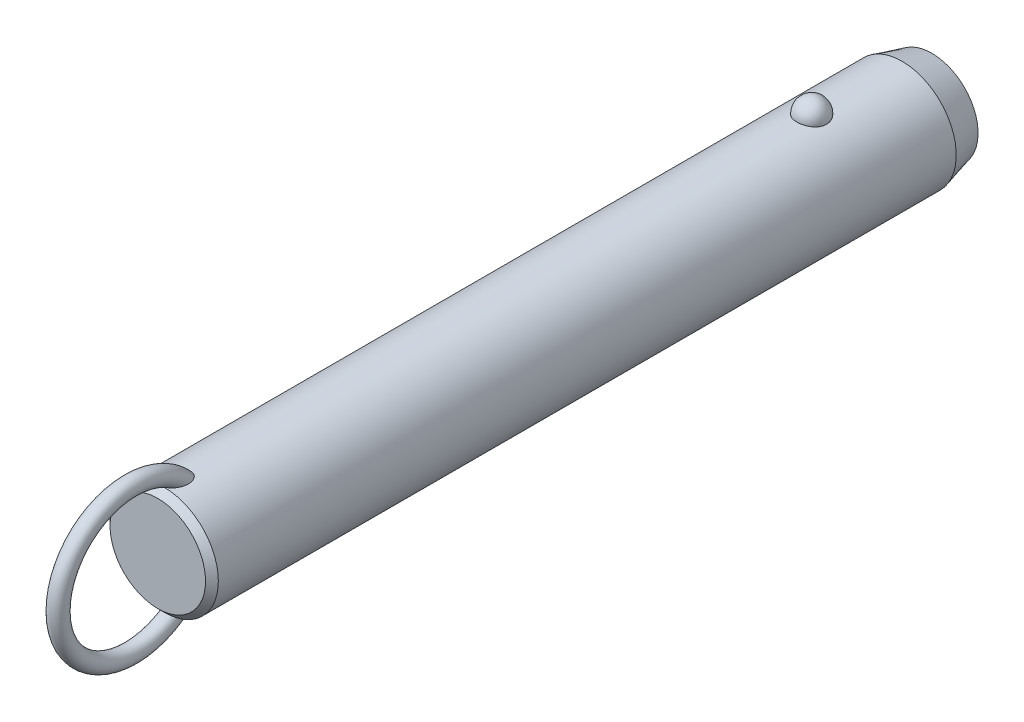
ISO-10303-21;
HEADER;
FILE_DESCRIPTION(('STEP AP214'),'2;1');
FILE_NAME('part.step','',(''),(''),'','','');
FILE_SCHEMA(('AUTOMOTIVE_DESIGN { 1 0 10303 214 1 1 1 1 }'));
ENDSEC;
DATA;
#1=APPLICATION_CONTEXT('core data for automotive mechanical design processes');
#2=APPLICATION_PROTOCOL_DEFINITION('international standard','automotive_design',2000,#1);
#3=PRODUCT_CONTEXT('',#1,'mechanical');
#4=PRODUCT('Part','Part','',(#3));
#5=PRODUCT_RELATED_PRODUCT_CATEGORY('part','',(#4));
#6=PRODUCT_DEFINITION_FORMATION('','',#4);
#7=PRODUCT_DEFINITION_CONTEXT('part definition',#1,'design');
#8=PRODUCT_DEFINITION('design','',#6,#7);
#9=PRODUCT_DEFINITION_SHAPE('','',#8);
#10=(LENGTH_UNIT() NAMED_UNIT(*) SI_UNIT(.MILLI.,.METRE.));
#11=(NAMED_UNIT(*) PLANE_ANGLE_UNIT() SI_UNIT($,.RADIAN.));
#12=(NAMED_UNIT(*) SI_UNIT($,.STERADIAN.) SOLID_ANGLE_UNIT());
#13=UNCERTAINTY_MEASURE_WITH_UNIT(LENGTH_MEASURE(1.E-05),#10,'distance_accuracy_value','');
#14=(GEOMETRIC_REPRESENTATION_CONTEXT(3) GLOBAL_UNCERTAINTY_ASSIGNED_CONTEXT((#13)) GLOBAL_UNIT_ASSIGNED_CONTEXT((#10,
#11,#12)) REPRESENTATION_CONTEXT('',''));
#15=CARTESIAN_POINT('',(0.,0.,0.));
#16=DIRECTION('',(0.,0.,1.));
#17=DIRECTION('',(1.,0.,0.));
#18=AXIS2_PLACEMENT_3D('',#15,#16,#17);
#19=CARTESIAN_POINT('',(0.,0.,137.2));
#20=DIRECTION('',(0.,0.,-1.));
#21=DIRECTION('',(-1.,0.,0.));
#22=AXIS2_PLACEMENT_3D('',#19,#20,#21);
#23=CYLINDRICAL_SURFACE('',#22,12.7);
#24=CARTESIAN_POINT('',(3.46661256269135,12.2177165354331,-3.5));
#25=CARTESIAN_POINT('',(3.4666090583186,12.2177194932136,-3.30432790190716));
#26=CARTESIAN_POINT('',(3.45063567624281,12.2222841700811,-3.10861112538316));
#27=CARTESIAN_POINT('',(3.38712451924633,12.2400345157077,-2.72271899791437));
#28=CARTESIAN_POINT('',(3.33957415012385,12.2532236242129,-2.53254588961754));
#29=CARTESIAN_POINT('',(3.2141234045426,12.286724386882,-2.16324948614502));
#30=CARTESIAN_POINT('',(3.13623639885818,12.3070329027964,-1.98412136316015));
#31=CARTESIAN_POINT('',(2.95205930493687,12.3525018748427,-1.64180592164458));
#32=CARTESIAN_POINT('',(2.84577003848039,12.3776621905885,-1.47861814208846));
#33=CARTESIAN_POINT('',(2.60688050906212,12.4301712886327,-1.17190583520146));
#34=CARTESIAN_POINT('',(2.47415697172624,12.4575299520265,-1.02847897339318));
#35=CARTESIAN_POINT('',(2.18615174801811,12.5112810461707,-0.766177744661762));
#36=CARTESIAN_POINT('',(2.03087002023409,12.5376734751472,-0.64730342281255));
#37=CARTESIAN_POINT('',(1.70237334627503,12.5864761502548,-0.437732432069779));
#38=CARTESIAN_POINT('',(1.52920948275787,12.6088972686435,-0.346958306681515));
#39=CARTESIAN_POINT('',(1.16944170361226,12.6473352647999,-0.195750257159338));
#40=CARTESIAN_POINT('',(0.982839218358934,12.663352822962,-0.135313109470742));
#41=CARTESIAN_POINT('',(0.604961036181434,12.6869706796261,-0.0473241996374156));
#42=CARTESIAN_POINT('',(0.41382314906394,12.6947125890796,-0.0192185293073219));
#43=CARTESIAN_POINT('',(0.0293827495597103,12.7014203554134,0.0051725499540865));
#44=CARTESIAN_POINT('',(-0.163919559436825,12.7003870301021,0.00146092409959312));
#45=CARTESIAN_POINT('',(-0.544374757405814,12.689735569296,-0.0373939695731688));
#46=CARTESIAN_POINT('',(-0.731575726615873,12.6802364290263,-0.0721015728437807));
#47=CARTESIAN_POINT('',(-1.09733277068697,12.6538333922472,-0.171364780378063));
#48=CARTESIAN_POINT('',(-1.27588869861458,12.6369293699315,-0.235920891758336));
#49=CARTESIAN_POINT('',(-1.6204698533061,12.5973946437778,-0.393548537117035));
#50=CARTESIAN_POINT('',(-1.78641865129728,12.5747321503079,-0.486778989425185));
#51=CARTESIAN_POINT('',(-2.10030671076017,12.5261316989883,-0.699110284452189));
#52=CARTESIAN_POINT('',(-2.24824419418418,12.5001934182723,-0.818213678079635));
#53=CARTESIAN_POINT('',(-2.52491489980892,12.4472906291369,-1.08157124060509));
#54=CARTESIAN_POINT('',(-2.65324222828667,12.4203160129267,-1.22624992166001));
#55=CARTESIAN_POINT('',(-2.88410007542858,12.3687509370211,-1.53528325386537));
#56=CARTESIAN_POINT('',(-2.98662883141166,12.3441606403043,-1.69963924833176));
#57=CARTESIAN_POINT('',(-3.16432417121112,12.2998199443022,-2.04548497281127));
#58=CARTESIAN_POINT('',(-3.23917525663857,12.2801261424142,-2.22714424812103));
#59=CARTESIAN_POINT('',(-3.35800573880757,12.248167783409,-2.6009138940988));
#60=CARTESIAN_POINT('',(-3.4019860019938,12.2359030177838,-2.79302397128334));
#61=CARTESIAN_POINT('',(-3.45784812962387,12.2202347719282,-3.18140279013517));
#62=CARTESIAN_POINT('',(-3.46986123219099,12.2167950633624,-3.37765118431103));
#63=CARTESIAN_POINT('',(-3.46186273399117,12.2190638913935,-3.76943689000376));
#64=CARTESIAN_POINT('',(-3.44185196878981,12.2247721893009,-3.96497421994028));
#65=CARTESIAN_POINT('',(-3.37048652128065,12.2446381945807,-4.34881728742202));
#66=CARTESIAN_POINT('',(-3.31928253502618,12.2587552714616,-4.53715319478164));
#67=CARTESIAN_POINT('',(-3.18693461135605,12.2938237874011,-4.90231727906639));
#68=CARTESIAN_POINT('',(-3.1057895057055,12.3147754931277,-5.07914500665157));
#69=CARTESIAN_POINT('',(-2.91506431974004,12.3613125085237,-5.41732059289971));
#70=CARTESIAN_POINT('',(-2.80533587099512,12.3869217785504,-5.57858147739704));
#71=CARTESIAN_POINT('',(-2.560414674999,12.4398525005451,-5.88013283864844));
#72=CARTESIAN_POINT('',(-2.42522099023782,12.4671740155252,-6.02042254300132));
#73=CARTESIAN_POINT('',(-2.1323357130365,12.5205965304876,-6.27662798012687));
#74=CARTESIAN_POINT('',(-1.97456596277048,12.5466928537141,-6.3924554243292));
#75=CARTESIAN_POINT('',(-1.64115839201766,12.5946384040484,-6.59583547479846));
#76=CARTESIAN_POINT('',(-1.46552179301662,12.6164879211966,-6.68339001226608));
#77=CARTESIAN_POINT('',(-1.10356050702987,12.6532533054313,-6.82682153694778));
#78=CARTESIAN_POINT('',(-0.9173913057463,12.6682500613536,-6.8830698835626));
#79=CARTESIAN_POINT('',(-0.537836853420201,12.6900288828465,-6.96386887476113));
#80=CARTESIAN_POINT('',(-0.344452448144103,12.6968119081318,-6.9884232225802));
#81=CARTESIAN_POINT('',(0.0402577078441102,12.7013667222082,-7.00496469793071));
#82=CARTESIAN_POINT('',(0.231556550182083,12.6993008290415,-6.99753844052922));
#83=CARTESIAN_POINT('',(0.610105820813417,12.6867505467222,-6.9516636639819));
#84=CARTESIAN_POINT('',(0.797356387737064,12.6762664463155,-6.913216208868));
#85=CARTESIAN_POINT('',(1.16186657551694,12.6480587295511,-6.80658431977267));
#86=CARTESIAN_POINT('',(1.33915951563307,12.6303611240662,-6.73850666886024));
#87=CARTESIAN_POINT('',(1.67968518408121,12.5896027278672,-6.5745087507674));
#88=CARTESIAN_POINT('',(1.84291705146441,12.5665416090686,-6.47858678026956));
#89=CARTESIAN_POINT('',(2.15340192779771,12.5171072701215,-6.25982455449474));
#90=CARTESIAN_POINT('',(2.30037831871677,12.4906895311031,-6.13660186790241));
#91=CARTESIAN_POINT('',(2.5717412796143,12.4376567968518,-5.86739587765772));
#92=CARTESIAN_POINT('',(2.69612388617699,12.4110417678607,-5.72140858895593));
#93=CARTESIAN_POINT('',(2.92107785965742,12.360051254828,-5.40794137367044));
#94=CARTESIAN_POINT('',(3.02121329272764,12.3357209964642,-5.24014110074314));
#95=CARTESIAN_POINT('',(3.19236291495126,12.2925446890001,-4.88969865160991));
#96=CARTESIAN_POINT('',(3.26338839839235,12.2736965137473,-4.70706226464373));
#97=CARTESIAN_POINT('',(3.36788038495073,12.245404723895,-4.35469510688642));
#98=CARTESIAN_POINT('',(3.40484026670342,12.2351018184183,-4.18605935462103));
#99=CARTESIAN_POINT('',(3.45420764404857,12.2212564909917,-3.84496058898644));
#100=CARTESIAN_POINT('',(3.46661565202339,12.2177139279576,-3.67249765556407));
#101=CARTESIAN_POINT('',(3.46661256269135,12.2177165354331,-3.5));
#102=B_SPLINE_CURVE_WITH_KNOTS('',3,(#24,#25,#26,#27,#28,#29,#30,#31,#32,#33,#34,#35,#36,#37,
#38,#39,#40,#41,#42,#43,#44,#45,#46,#47,#48,#49,#50,#51,#52,#53,#54,#55,#56,#57,#58,#59,#60,#61,
#62,#63,#64,#65,#66,#67,#68,#69,#70,#71,#72,#73,#74,#75,#76,#77,#78,#79,#80,#81,#82,#83,#84,#85,
#86,#87,#88,#89,#90,#91,#92,#93,#94,#95,#96,#97,#98,#99,#100,#101),.UNSPECIFIED.,.T.,.F.,(4,2,2,
2,2,2,2,2,2,2,2,2,2,2,2,2,2,2,2,2,2,2,2,2,2,2,2,2,2,2,2,2,2,2,2,2,2,2,4),(0.,0.586396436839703,
1.17302689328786,1.7593990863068,2.34575431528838,2.93491084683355,3.52406845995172,
4.11158733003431,4.69904375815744,5.2762784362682,5.85345931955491,6.42265312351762,
6.99185659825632,7.56427334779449,8.136746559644,8.71981013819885,9.3029135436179,
9.89247258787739,10.4820150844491,11.0691335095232,11.6562366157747,12.2405256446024,
12.8248374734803,13.412244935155,13.9996740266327,14.5891883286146,15.1786623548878,
15.7609861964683,16.3432419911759,16.9148635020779,17.4864654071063,18.0560241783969,
18.6256177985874,19.2037609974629,19.7820055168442,20.3699810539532,20.957728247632,
21.4746855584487,21.9916320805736),.UNSPECIFIED.);
#103=CARTESIAN_POINT('',(3.46661256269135,12.2177165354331,-3.5));
#104=VERTEX_POINT('',#103);
#105=EDGE_CURVE('E41',#104,#104,#102,.T.);
#106=ORIENTED_EDGE('',*,*,#105,.T.);
#107=EDGE_LOOP('',(#106));
#108=FACE_BOUND('',#107,.T.);
#109=CARTESIAN_POINT('',(0.,0.,148.4));
#110=DIRECTION('',(0.,0.,1.));
#111=DIRECTION('',(1.,0.,0.));
#112=AXIS2_PLACEMENT_3D('',#109,#110,#111);
#113=CIRCLE('',#112,12.7);
#114=CARTESIAN_POINT('',(12.7,0.,148.4));
#115=VERTEX_POINT('',#114);
#116=EDGE_CURVE('E10',#115,#115,#113,.F.);
#117=ORIENTED_EDGE('',*,*,#116,.T.);
#118=EDGE_LOOP('',(#117));
#119=FACE_BOUND('',#118,.T.);
#120=CARTESIAN_POINT('',(-0.548122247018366,-12.6881662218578,142.143218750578));
#121=CARTESIAN_POINT('',(-0.648865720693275,-12.6838128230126,142.177926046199));
#122=CARTESIAN_POINT('',(-0.746398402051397,-12.6783867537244,142.222042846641));
#123=CARTESIAN_POINT('',(-0.932125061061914,-12.666091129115,142.326764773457));
#124=CARTESIAN_POINT('',(-1.02030388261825,-12.6592192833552,142.387396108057));
#125=CARTESIAN_POINT('',(-1.18487740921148,-12.6448747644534,142.521847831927));
#126=CARTESIAN_POINT('',(-1.26134296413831,-12.637406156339,142.595582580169));
#127=CARTESIAN_POINT('',(-1.4023120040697,-12.6225412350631,142.753604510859));
#128=CARTESIAN_POINT('',(-1.466814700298,-12.6151449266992,142.83789238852));
#129=CARTESIAN_POINT('',(-1.60714786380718,-12.5981718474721,143.049657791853));
#130=CARTESIAN_POINT('',(-1.67725126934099,-12.588900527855,143.180962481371));
#131=CARTESIAN_POINT('',(-1.79536591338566,-12.5725964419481,143.453247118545));
#132=CARTESIAN_POINT('',(-1.84333535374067,-12.5655679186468,143.594244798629));
#133=CARTESIAN_POINT('',(-1.93422576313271,-12.5519624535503,143.937645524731));
#134=CARTESIAN_POINT('',(-1.96788773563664,-12.5466298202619,144.142557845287));
#135=CARTESIAN_POINT('',(-1.9941399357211,-12.542463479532,144.451760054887));
#136=CARTESIAN_POINT('',(-1.99883864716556,-12.5417153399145,144.555298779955));
#137=CARTESIAN_POINT('',(-2.00078003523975,-12.5414074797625,144.76245124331));
#138=CARTESIAN_POINT('',(-1.99802449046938,-12.5418474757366,144.866064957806));
#139=CARTESIAN_POINT('',(-1.98336733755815,-12.5441750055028,145.11032076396));
#140=CARTESIAN_POINT('',(-1.96851430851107,-12.5465291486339,145.250780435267));
#141=CARTESIAN_POINT('',(-1.92707089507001,-12.5529612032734,145.529960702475));
#142=CARTESIAN_POINT('',(-1.90047458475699,-12.5570399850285,145.668680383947));
#143=CARTESIAN_POINT('',(-1.8361912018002,-12.5666008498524,145.94341135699));
#144=CARTESIAN_POINT('',(-1.79850828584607,-12.57208240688,146.079423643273));
#145=CARTESIAN_POINT('',(-1.71223796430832,-12.5841228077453,146.347842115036));
#146=CARTESIAN_POINT('',(-1.66365679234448,-12.5906810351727,146.480250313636));
#147=CARTESIAN_POINT('',(-1.5780450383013,-12.6016176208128,146.68548877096));
#148=CARTESIAN_POINT('',(-1.54477252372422,-12.6057501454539,146.759914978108));
#149=CARTESIAN_POINT('',(-1.47424480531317,-12.6141930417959,146.906839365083));
#150=CARTESIAN_POINT('',(-1.436990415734,-12.6185033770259,146.979337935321));
#151=CARTESIAN_POINT('',(-1.35825795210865,-12.6272207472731,147.121892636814));
#152=CARTESIAN_POINT('',(-1.31678520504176,-12.6316276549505,147.191951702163));
#153=CARTESIAN_POINT('',(-1.22917793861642,-12.6404532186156,147.329070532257));
#154=CARTESIAN_POINT('',(-1.18304514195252,-12.6448718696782,147.396131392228));
#155=CARTESIAN_POINT('',(-1.0724641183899,-12.6547893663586,147.543874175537));
#156=CARTESIAN_POINT('',(-1.00642239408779,-12.6602600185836,147.623384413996));
#157=CARTESIAN_POINT('',(-0.864441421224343,-12.6707460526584,147.773169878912));
#158=CARTESIAN_POINT('',(-0.78851691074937,-12.6757620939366,147.843458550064));
#159=CARTESIAN_POINT('',(-0.65221547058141,-12.6833591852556,147.948680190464));
#160=CARTESIAN_POINT('',(-0.59498203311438,-12.6861973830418,147.987624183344));
#161=CARTESIAN_POINT('',(-0.475269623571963,-12.6912445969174,148.056489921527));
#162=CARTESIAN_POINT('',(-0.412800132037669,-12.6934547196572,148.086427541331));
#163=CARTESIAN_POINT('',(-0.295749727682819,-12.6966636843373,148.12975652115));
#164=CARTESIAN_POINT('',(-0.241949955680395,-12.6978134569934,148.145218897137));
#165=CARTESIAN_POINT('',(-0.132508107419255,-12.6994261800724,148.166884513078));
#166=CARTESIAN_POINT('',(-0.0768679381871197,-12.6998898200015,148.173097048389));
#167=CARTESIAN_POINT('',(0.03476966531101,-12.7000752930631,148.175583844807));
#168=CARTESIAN_POINT('',(0.0907676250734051,-12.6997954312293,148.171835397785));
#169=CARTESIAN_POINT('',(0.201283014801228,-12.6985255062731,148.154788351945));
#170=CARTESIAN_POINT('',(0.255799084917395,-12.6975348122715,148.141481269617));
#171=CARTESIAN_POINT('',(0.376042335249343,-12.6946091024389,148.10203792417));
#172=CARTESIAN_POINT('',(0.440950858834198,-12.6924943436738,148.073449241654));
#173=CARTESIAN_POINT('',(0.565350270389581,-12.6875639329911,148.006323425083));
#174=CARTESIAN_POINT('',(0.624828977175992,-12.6847467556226,147.967764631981));
#175=CARTESIAN_POINT('',(0.774116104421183,-12.6767252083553,147.856949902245));
#176=CARTESIAN_POINT('',(0.859449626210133,-12.6711344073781,147.778760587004));
#177=CARTESIAN_POINT('',(1.01789440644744,-12.6593922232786,147.610943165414));
#178=CARTESIAN_POINT('',(1.09096902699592,-12.653239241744,147.521282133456));
#179=CARTESIAN_POINT('',(1.22268793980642,-12.6411674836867,147.340265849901));
#180=CARTESIAN_POINT('',(1.28193986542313,-12.6352572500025,147.249345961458));
#181=CARTESIAN_POINT('',(1.39259777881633,-12.6235401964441,147.062792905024));
#182=CARTESIAN_POINT('',(1.44399707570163,-12.6177334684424,146.967155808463));
#183=CARTESIAN_POINT('',(1.53972870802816,-12.6064093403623,146.772273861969));
#184=CARTESIAN_POINT('',(1.58405262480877,-12.6008922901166,146.673024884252));
#185=CARTESIAN_POINT('',(1.66600705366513,-12.5903187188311,146.471772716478));
#186=CARTESIAN_POINT('',(1.70363651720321,-12.5852622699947,146.369769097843));
#187=CARTESIAN_POINT('',(1.77545379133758,-12.5753406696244,146.154358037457));
#188=CARTESIAN_POINT('',(1.80903453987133,-12.5705328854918,146.040745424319));
#189=CARTESIAN_POINT('',(1.86844163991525,-12.5618400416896,145.811457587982));
#190=CARTESIAN_POINT('',(1.89426665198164,-12.5579551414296,145.695782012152));
#191=CARTESIAN_POINT('',(1.9378546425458,-12.5513030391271,145.463007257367));
#192=CARTESIAN_POINT('',(1.95562640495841,-12.5485346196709,145.345909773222));
#193=CARTESIAN_POINT('',(1.98264463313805,-12.5442934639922,145.110747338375));
#194=CARTESIAN_POINT('',(1.99189298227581,-12.5428204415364,144.99268260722));
#195=CARTESIAN_POINT('',(2.00416068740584,-12.540871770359,144.680622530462));
#196=CARTESIAN_POINT('',(1.99944433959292,-12.541631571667,144.486229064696));
#197=CARTESIAN_POINT('',(1.96113755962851,-12.5476846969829,144.100309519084));
#198=CARTESIAN_POINT('',(1.92758341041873,-12.5529723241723,143.908780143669));
#199=CARTESIAN_POINT('',(1.83934342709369,-12.5661532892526,143.582272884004));
#200=CARTESIAN_POINT('',(1.79215440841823,-12.5730485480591,143.44524997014));
#201=CARTESIAN_POINT('',(1.67676242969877,-12.588958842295,143.180445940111));
#202=CARTESIAN_POINT('',(1.60859050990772,-12.597970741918,143.052651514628));
#203=CARTESIAN_POINT('',(1.46583832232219,-12.6152829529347,142.835800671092));
#204=CARTESIAN_POINT('',(1.39525727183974,-12.6233659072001,142.74410500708));
#205=CARTESIAN_POINT('',(1.23992594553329,-12.6395676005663,142.573485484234));
#206=CARTESIAN_POINT('',(1.15517932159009,-12.6476863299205,142.494558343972));
#207=CARTESIAN_POINT('',(0.971995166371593,-12.6630846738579,142.352643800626));
#208=CARTESIAN_POINT('',(0.873456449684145,-12.6703572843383,142.289784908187));
#209=CARTESIAN_POINT('',(0.665847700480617,-12.6829569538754,142.184487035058));
#210=CARTESIAN_POINT('',(0.556784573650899,-12.688285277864,142.142034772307));
#211=CARTESIAN_POINT('',(0.347338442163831,-12.6956226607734,142.084443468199));
#212=CARTESIAN_POINT('',(0.247759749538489,-12.6979816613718,142.066399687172));
#213=CARTESIAN_POINT('',(0.0470218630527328,-12.7003077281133,142.048600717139));
#214=CARTESIAN_POINT('',(-0.0541350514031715,-12.7002779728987,142.048821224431));
#215=CARTESIAN_POINT('',(-0.221414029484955,-12.6982482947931,142.064363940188));
#216=CARTESIAN_POINT('',(-0.288055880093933,-12.6969033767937,142.074666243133));
#217=CARTESIAN_POINT('',(-0.419599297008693,-12.6932369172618,142.10313489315));
#218=CARTESIAN_POINT('',(-0.484501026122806,-12.6909154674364,142.121300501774));
#219=CARTESIAN_POINT('',(-0.548122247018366,-12.6881662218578,142.143218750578));
#220=B_SPLINE_CURVE_WITH_KNOTS('',3,(#120,#121,#122,#123,#124,#125,#126,#127,#128,#129,#130,
#131,#132,#133,#134,#135,#136,#137,#138,#139,#140,#141,#142,#143,#144,#145,#146,#147,#148,#149,
#150,#151,#152,#153,#154,#155,#156,#157,#158,#159,#160,#161,#162,#163,#164,#165,#166,#167,#168,
#169,#170,#171,#172,#173,#174,#175,#176,#177,#178,#179,#180,#181,#182,#183,#184,#185,#186,#187,
#188,#189,#190,#191,#192,#193,#194,#195,#196,#197,#198,#199,#200,#201,#202,#203,#204,#205,#206,
#207,#208,#209,#210,#211,#212,#213,#214,#215,#216,#217,#218,#219),.UNSPECIFIED.,.T.,.F.,(4,2,2,
2,2,2,2,2,2,2,2,2,2,2,2,2,2,2,2,2,2,2,2,2,2,2,2,2,2,2,2,2,2,2,2,2,2,2,2,2,2,2,2,2,2,2,2,2,2,4),
(0.,0.31964225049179,0.639794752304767,0.957927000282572,1.27608021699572,1.72100165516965,
2.16675988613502,2.78630021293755,3.09705782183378,3.40774128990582,3.83096358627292,
4.25439969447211,4.67767724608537,5.10071330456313,5.34550297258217,5.59024267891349,
5.83467707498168,6.07902143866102,6.38891080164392,6.69834321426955,6.9056091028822,
7.11250749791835,7.27977315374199,7.44687060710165,7.61434932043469,7.78197685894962,
7.99365544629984,8.20579780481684,8.55147335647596,8.89816429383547,9.22375138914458,
9.54961437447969,9.87586224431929,10.202161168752,10.557587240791,10.9130746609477,
11.2681734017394,11.6231936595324,12.2046601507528,12.7853961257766,13.219164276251,
13.6522938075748,13.9989174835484,14.3454519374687,14.6946768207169,15.0436740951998,
15.3457513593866,15.6474266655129,15.8493051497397,16.0511646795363),.UNSPECIFIED.);
#221=CARTESIAN_POINT('',(-0.548122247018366,-12.6881662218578,142.143218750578));
#222=VERTEX_POINT('',#221);
#223=EDGE_CURVE('E59',#222,#222,#220,.T.);
#224=ORIENTED_EDGE('',*,*,#223,.T.);
#225=EDGE_LOOP('',(#224));
#226=FACE_BOUND('',#225,.T.);
#227=CARTESIAN_POINT('',(-0.548122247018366,12.6881662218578,142.143218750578));
#228=CARTESIAN_POINT('',(-0.459436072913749,12.6919968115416,142.112673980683));
#229=CARTESIAN_POINT('',(-0.368189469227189,12.6949996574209,142.089391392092));
#230=CARTESIAN_POINT('',(-0.18302400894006,12.6990186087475,142.058406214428));
#231=CARTESIAN_POINT('',(-0.0891049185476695,12.7000345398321,142.050704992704));
#232=CARTESIAN_POINT('',(0.0987147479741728,12.6999636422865,142.051245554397));
#233=CARTESIAN_POINT('',(0.192615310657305,12.6988761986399,142.059492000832));
#234=CARTESIAN_POINT('',(0.377658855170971,12.6947211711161,142.091551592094));
#235=CARTESIAN_POINT('',(0.468801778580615,12.6916535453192,142.115365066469));
#236=CARTESIAN_POINT('',(0.645809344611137,12.6838788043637,142.17745651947));
#237=CARTESIAN_POINT('',(0.731679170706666,12.6791733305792,142.215720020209));
#238=CARTESIAN_POINT('',(0.896315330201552,12.6686004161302,142.305120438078));
#239=CARTESIAN_POINT('',(0.975080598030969,12.6627328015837,142.356259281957));
#240=CARTESIAN_POINT('',(1.12963655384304,12.6499161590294,142.47367820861));
#241=CARTESIAN_POINT('',(1.20478673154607,12.6429194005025,142.540792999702));
#242=CARTESIAN_POINT('',(1.34448241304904,12.6288282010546,142.68522507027));
#243=CARTESIAN_POINT('',(1.40902173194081,12.621733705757,142.762548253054));
#244=CARTESIAN_POINT('',(1.55208211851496,12.6050877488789,142.959247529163));
#245=CARTESIAN_POINT('',(1.62510490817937,12.5957546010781,143.082654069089));
#246=CARTESIAN_POINT('',(1.7501904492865,12.5789823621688,143.339769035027));
#247=CARTESIAN_POINT('',(1.80221377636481,12.5715468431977,143.473496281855));
#248=CARTESIAN_POINT('',(1.90309965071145,12.5567434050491,143.798351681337));
#249=CARTESIAN_POINT('',(1.94342317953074,12.5504515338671,143.992161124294));
#250=CARTESIAN_POINT('',(1.99332997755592,12.5426147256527,144.38378810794));
#251=CARTESIAN_POINT('',(2.00285305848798,12.5410790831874,144.581612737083));
#252=CARTESIAN_POINT('',(1.99678999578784,12.5420407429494,144.916642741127));
#253=CARTESIAN_POINT('',(1.98794117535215,12.5434564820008,145.054042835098));
#254=CARTESIAN_POINT('',(1.95865119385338,12.5480641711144,145.327639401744));
#255=CARTESIAN_POINT('',(1.93820436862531,12.5512569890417,145.463835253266));
#256=CARTESIAN_POINT('',(1.88647896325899,12.5591352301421,145.734249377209));
#257=CARTESIAN_POINT('',(1.85518800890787,12.5638223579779,145.868465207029));
#258=CARTESIAN_POINT('',(1.78217886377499,12.5743868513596,146.133936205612));
#259=CARTESIAN_POINT('',(1.74046509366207,12.5802637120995,146.265192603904));
#260=CARTESIAN_POINT('',(1.66024095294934,12.5910571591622,146.486085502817));
#261=CARTESIAN_POINT('',(1.62434772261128,12.5957535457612,146.576690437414));
#262=CARTESIAN_POINT('',(1.54709009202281,12.6054762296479,146.755512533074));
#263=CARTESIAN_POINT('',(1.50572681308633,12.6105024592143,146.843730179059));
#264=CARTESIAN_POINT('',(1.41728020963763,12.620748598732,147.016932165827));
#265=CARTESIAN_POINT('',(1.37021377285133,12.625967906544,147.101925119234));
#266=CARTESIAN_POINT('',(1.26969620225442,12.6364721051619,147.268007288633));
#267=CARTESIAN_POINT('',(1.21624929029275,12.6417569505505,147.349099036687));
#268=CARTESIAN_POINT('',(1.10304413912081,12.6521331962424,147.504702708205));
#269=CARTESIAN_POINT('',(1.04340936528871,12.657226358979,147.579303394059));
#270=CARTESIAN_POINT('',(0.915919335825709,12.667090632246,147.721324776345));
#271=CARTESIAN_POINT('',(0.848064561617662,12.6718617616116,147.78874589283));
#272=CARTESIAN_POINT('',(0.717035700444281,12.67987711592,147.900624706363));
#273=CARTESIAN_POINT('',(0.655526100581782,12.6832377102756,147.946997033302));
#274=CARTESIAN_POINT('',(0.525985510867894,12.6892676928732,148.029619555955));
#275=CARTESIAN_POINT('',(0.457969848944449,12.6919386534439,148.065892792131));
#276=CARTESIAN_POINT('',(0.334859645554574,12.695691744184,148.116657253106));
#277=CARTESIAN_POINT('',(0.281116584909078,12.6970073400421,148.134373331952));
#278=CARTESIAN_POINT('',(0.171425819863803,12.6989609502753,148.160642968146));
#279=CARTESIAN_POINT('',(0.115480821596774,12.699599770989,148.169207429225));
#280=CARTESIAN_POINT('',(0.00272618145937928,12.7001251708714,148.176253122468));
#281=CARTESIAN_POINT('',(-0.0540859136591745,12.7000089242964,148.174696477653));
#282=CARTESIAN_POINT('',(-0.166544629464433,12.6990328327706,148.161600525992));
#283=CARTESIAN_POINT('',(-0.222190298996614,12.6981724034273,148.150053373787));
#284=CARTESIAN_POINT('',(-0.342018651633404,12.695562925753,148.114912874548));
#285=CARTESIAN_POINT('',(-0.405606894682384,12.6936676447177,148.08933225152));
#286=CARTESIAN_POINT('',(-0.527815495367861,12.6891754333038,148.028311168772));
#287=CARTESIAN_POINT('',(-0.586425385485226,12.6865770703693,147.992850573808));
#288=CARTESIAN_POINT('',(-0.731842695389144,12.6792129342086,147.891496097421));
#289=CARTESIAN_POINT('',(-0.81470941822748,12.6740767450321,147.8200395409));
#290=CARTESIAN_POINT('',(-0.969101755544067,12.6632083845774,147.66589007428));
#291=CARTESIAN_POINT('',(-1.04059564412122,12.6574746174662,147.583166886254));
#292=CARTESIAN_POINT('',(-1.16981116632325,12.6461638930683,147.415809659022));
#293=CARTESIAN_POINT('',(-1.22811369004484,12.6405994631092,147.331616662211));
#294=CARTESIAN_POINT('',(-1.33743405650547,12.6295007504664,147.158579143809));
#295=CARTESIAN_POINT('',(-1.38844577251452,12.6239664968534,147.069730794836));
#296=CARTESIAN_POINT('',(-1.48400702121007,12.6130898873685,146.888389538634));
#297=CARTESIAN_POINT('',(-1.52854232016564,12.6077479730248,146.795889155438));
#298=CARTESIAN_POINT('',(-1.61150113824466,12.5974127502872,146.608160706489));
#299=CARTESIAN_POINT('',(-1.64992317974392,12.5924195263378,146.512931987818));
#300=CARTESIAN_POINT('',(-1.73468589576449,12.581070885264,146.28289362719));
#301=CARTESIAN_POINT('',(-1.77831261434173,12.5749388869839,146.147066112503));
#302=CARTESIAN_POINT('',(-1.85439734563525,12.5639437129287,145.872212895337));
#303=CARTESIAN_POINT('',(-1.88684994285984,12.5590811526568,145.733185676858));
#304=CARTESIAN_POINT('',(-1.94008483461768,12.550968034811,145.45309235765));
#305=CARTESIAN_POINT('',(-1.96088706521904,12.5477147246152,145.312030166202));
#306=CARTESIAN_POINT('',(-1.99000539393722,12.5431291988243,145.028668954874));
#307=CARTESIAN_POINT('',(-1.99832911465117,12.5417958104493,144.886370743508));
#308=CARTESIAN_POINT('',(-2.00166624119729,12.5412674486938,144.557627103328));
#309=CARTESIAN_POINT('',(-1.99178843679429,12.5428579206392,144.371088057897));
#310=CARTESIAN_POINT('',(-1.94455183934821,12.5502731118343,144.00162404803));
#311=CARTESIAN_POINT('',(-1.90724032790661,12.5560905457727,143.818693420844));
#312=CARTESIAN_POINT('',(-1.81330718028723,12.5699462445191,143.504848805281));
#313=CARTESIAN_POINT('',(-1.76338820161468,12.5771273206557,143.371910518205));
#314=CARTESIAN_POINT('',(-1.64305018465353,12.593414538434,143.115681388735));
#315=CARTESIAN_POINT('',(-1.57265346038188,12.6025185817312,142.992380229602));
#316=CARTESIAN_POINT('',(-1.42634956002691,12.6198178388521,142.783564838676));
#317=CARTESIAN_POINT('',(-1.35423772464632,12.6278405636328,142.695384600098));
#318=CARTESIAN_POINT('',(-1.19645664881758,12.6437632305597,142.532107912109));
#319=CARTESIAN_POINT('',(-1.1108053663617,12.6516633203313,142.456994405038));
#320=CARTESIAN_POINT('',(-0.947219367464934,12.6648319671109,142.337811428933));
#321=CARTESIAN_POINT('',(-0.871624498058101,12.670300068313,142.290541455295));
#322=CARTESIAN_POINT('',(-0.714161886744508,12.6801492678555,142.2077413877));
#323=CARTESIAN_POINT('',(-0.632295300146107,12.684530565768,142.17220913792));
#324=CARTESIAN_POINT('',(-0.548122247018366,12.6881662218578,142.143218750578));
#325=B_SPLINE_CURVE_WITH_KNOTS('',3,(#227,#228,#229,#230,#231,#232,#233,#234,#235,#236,#237,
#238,#239,#240,#241,#242,#243,#244,#245,#246,#247,#248,#249,#250,#251,#252,#253,#254,#255,#256,
#257,#258,#259,#260,#261,#262,#263,#264,#265,#266,#267,#268,#269,#270,#271,#272,#273,#274,#275,
#276,#277,#278,#279,#280,#281,#282,#283,#284,#285,#286,#287,#288,#289,#290,#291,#292,#293,#294,
#295,#296,#297,#298,#299,#300,#301,#302,#303,#304,#305,#306,#307,#308,#309,#310,#311,#312,#313,
#314,#315,#316,#317,#318,#319,#320,#321,#322,#323,#324),.UNSPECIFIED.,.T.,.F.,(4,2,2,2,2,2,2,2,
2,2,2,2,2,2,2,2,2,2,2,2,2,2,2,2,2,2,2,2,2,2,2,2,2,2,2,2,2,2,2,2,2,2,2,2,2,2,2,2,4),(0.,
0.281328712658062,0.562682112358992,0.844117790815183,1.12555942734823,1.40671982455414,
1.68792232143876,1.98972294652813,2.29169886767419,2.72039860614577,3.14989948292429,
3.74084916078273,4.33295293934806,4.74554109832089,5.15833092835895,5.57159335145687,
5.98468079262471,6.27722775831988,6.56971484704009,6.86135609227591,7.15280542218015,
7.43927407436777,7.72572595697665,7.95635862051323,8.18646071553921,8.35559393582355,
8.52452541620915,8.6940894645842,8.86378678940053,9.06834348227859,9.27332014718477,
9.60010414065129,9.92778432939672,10.2350252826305,10.5425229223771,10.8506864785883,
11.15892440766,11.5867893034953,12.0148612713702,12.4421984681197,12.8692745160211,
13.4279365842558,13.9856380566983,14.4107062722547,14.835313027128,15.1765567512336,
15.517351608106,15.7844129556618,16.051425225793),.UNSPECIFIED.);
#326=CARTESIAN_POINT('',(-0.548122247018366,12.6881662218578,142.143218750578));
#327=VERTEX_POINT('',#326);
#328=EDGE_CURVE('E67',#327,#327,#325,.T.);
#329=ORIENTED_EDGE('',*,*,#328,.T.);
#330=EDGE_LOOP('',(#329));
#331=FACE_BOUND('',#330,.T.);
#332=CARTESIAN_POINT('',(0.,0.,-24.6999999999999));
#333=DIRECTION('',(0.,0.,-1.));
#334=DIRECTION('',(-1.,0.,0.));
#335=AXIS2_PLACEMENT_3D('',#332,#333,#334);
#336=CIRCLE('',#335,12.7);
#337=CARTESIAN_POINT('',(-12.7,0.,-24.6999999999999));
#338=VERTEX_POINT('',#337);
#339=EDGE_CURVE('E56',#338,#338,#336,.F.);
#340=ORIENTED_EDGE('',*,*,#339,.T.);
#341=EDGE_LOOP('',(#340));
#342=FACE_BOUND('',#341,.T.);
#343=ADVANCED_FACE('F37',(#108,#119,#226,#331,#342),#23,.T.);
#344=CARTESIAN_POINT('',(0.,0.,-31.7));
#345=DIRECTION('',(0.,0.,-1.));
#346=DIRECTION('',(-1.,0.,0.));
#347=AXIS2_PLACEMENT_3D('',#344,#345,#346);
#348=PLANE('',#347);
#349=CARTESIAN_POINT('',(0.,0.,-31.7));
#350=DIRECTION('',(0.,0.,-1.));
#351=DIRECTION('',(-1.,0.,0.));
#352=AXIS2_PLACEMENT_3D('',#349,#350,#351);
#353=CIRCLE('',#352,10.8243556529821);
#354=CARTESIAN_POINT('',(-10.8243556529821,0.,-31.7));
#355=VERTEX_POINT('',#354);
#356=EDGE_CURVE('E66',#355,#355,#353,.T.);
#357=ORIENTED_EDGE('',*,*,#356,.T.);
#358=EDGE_LOOP('',(#357));
#359=FACE_BOUND('',#358,.T.);
#360=ADVANCED_FACE('F85',(#359),#348,.T.);
#361=CARTESIAN_POINT('',(0.,0.,-31.7));
#362=DIRECTION('',(0.,0.,1.));
#363=DIRECTION('',(1.,0.,0.));
#364=AXIS2_PLACEMENT_3D('',#361,#362,#363);
#365=CONICAL_SURFACE('',#364,10.8243556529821,0.261799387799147);
#366=ORIENTED_EDGE('',*,*,#339,.F.);
#367=EDGE_LOOP('',(#366));
#368=FACE_BOUND('',#367,.T.);
#369=ORIENTED_EDGE('',*,*,#356,.F.);
#370=EDGE_LOOP('',(#369));
#371=FACE_BOUND('',#370,.T.);
#372=ADVANCED_FACE('F83',(#368,#371),#365,.T.);
#373=CARTESIAN_POINT('',(0.,0.,149.9));
#374=DIRECTION('',(0.,0.,1.));
#375=DIRECTION('',(1.,0.,0.));
#376=AXIS2_PLACEMENT_3D('',#373,#374,#375);
#377=PLANE('',#376);
#378=CARTESIAN_POINT('',(0.,0.,149.9));
#379=DIRECTION('',(0.,0.,1.));
#380=DIRECTION('',(1.,0.,0.));
#381=AXIS2_PLACEMENT_3D('',#378,#379,#380);
#382=CIRCLE('',#381,11.2);
#383=CARTESIAN_POINT('',(11.2,0.,149.9));
#384=VERTEX_POINT('',#383);
#385=EDGE_CURVE('E50',#384,#384,#382,.T.);
#386=ORIENTED_EDGE('',*,*,#385,.T.);
#387=EDGE_LOOP('',(#386));
#388=FACE_BOUND('',#387,.T.);
#389=ADVANCED_FACE('F77',(#388),#377,.T.);
#390=CARTESIAN_POINT('',(0.,0.,156.25));
#391=DIRECTION('',(1.,0.,0.));
#392=DIRECTION('',(0.,0.,-1.));
#393=AXIS2_PLACEMENT_3D('',#390,#391,#392);
#394=TOROIDAL_SURFACE('',#393,17.05,2.);
#395=ORIENTED_EDGE('',*,*,#328,.F.);
#396=EDGE_LOOP('',(#395));
#397=FACE_BOUND('',#396,.T.);
#398=ORIENTED_EDGE('',*,*,#223,.F.);
#399=EDGE_LOOP('',(#398));
#400=FACE_BOUND('',#399,.T.);
#401=ADVANCED_FACE('F73',(#397,#400),#394,.T.);
#402=CARTESIAN_POINT('',(0.,0.,149.9));
#403=DIRECTION('',(0.,0.,-1.));
#404=DIRECTION('',(-1.,0.,0.));
#405=AXIS2_PLACEMENT_3D('',#402,#403,#404);
#406=CONICAL_SURFACE('',#405,11.2,0.785398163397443);
#407=ORIENTED_EDGE('',*,*,#116,.F.);
#408=EDGE_LOOP('',(#407));
#409=FACE_BOUND('',#408,.T.);
#410=ORIENTED_EDGE('',*,*,#385,.F.);
#411=EDGE_LOOP('',(#410));
#412=FACE_BOUND('',#411,.T.);
#413=ADVANCED_FACE('F39',(#409,#412),#406,.T.);
#414=CARTESIAN_POINT('',(0.,12.7,-3.5));
#415=DIRECTION('',(0.,1.,0.));
#416=DIRECTION('',(0.,0.,-1.));
#417=AXIS2_PLACEMENT_3D('',#414,#415,#416);
#418=SPHERICAL_SURFACE('',#417,3.5);
#419=ORIENTED_EDGE('',*,*,#105,.F.);
#420=EDGE_LOOP('',(#419));
#421=FACE_BOUND('',#420,.T.);
#422=ADVANCED_FACE('F79',(#421),#418,.T.);
#423=CLOSED_SHELL('',(#343,#360,#372,#389,#401,#413,#422));
#424=MANIFOLD_SOLID_BREP('B2',#423);
#425=ADVANCED_BREP_SHAPE_REPRESENTATION('',(#18,#424),#14);
#426=SHAPE_DEFINITION_REPRESENTATION(#9,#425);
ENDSEC;
END-ISO-10303-21;
